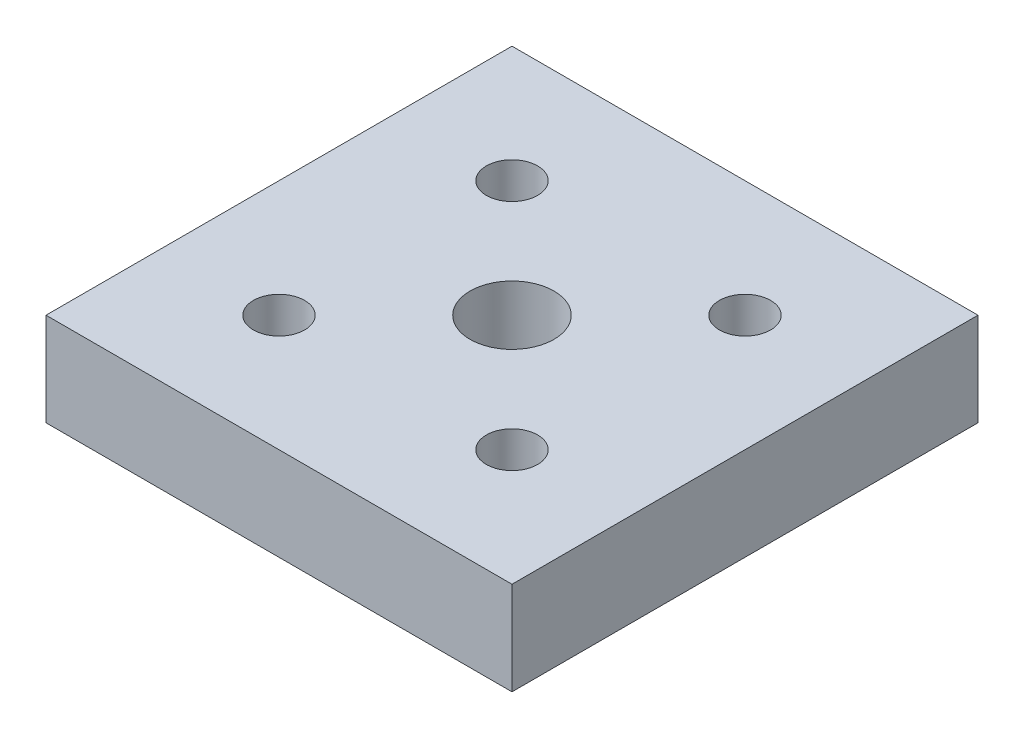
ISO-10303-21;
HEADER;
FILE_DESCRIPTION(('STEP AP214'),'2;1');
FILE_NAME('part.step','',(''),(''),'','','');
FILE_SCHEMA(('AUTOMOTIVE_DESIGN { 1 0 10303 214 1 1 1 1 }'));
ENDSEC;
DATA;
#1=APPLICATION_CONTEXT('core data for automotive mechanical design processes');
#2=APPLICATION_PROTOCOL_DEFINITION('international standard','automotive_design',2000,#1);
#3=PRODUCT_CONTEXT('',#1,'mechanical');
#4=PRODUCT('Part','Part','',(#3));
#5=PRODUCT_RELATED_PRODUCT_CATEGORY('part','',(#4));
#6=PRODUCT_DEFINITION_FORMATION('','',#4);
#7=PRODUCT_DEFINITION_CONTEXT('part definition',#1,'design');
#8=PRODUCT_DEFINITION('design','',#6,#7);
#9=PRODUCT_DEFINITION_SHAPE('','',#8);
#10=(LENGTH_UNIT() NAMED_UNIT(*) SI_UNIT(.MILLI.,.METRE.));
#11=(NAMED_UNIT(*) PLANE_ANGLE_UNIT() SI_UNIT($,.RADIAN.));
#12=(NAMED_UNIT(*) SI_UNIT($,.STERADIAN.) SOLID_ANGLE_UNIT());
#13=UNCERTAINTY_MEASURE_WITH_UNIT(LENGTH_MEASURE(1.E-05),#10,'distance_accuracy_value','');
#14=(GEOMETRIC_REPRESENTATION_CONTEXT(3) GLOBAL_UNCERTAINTY_ASSIGNED_CONTEXT((#13)) GLOBAL_UNIT_ASSIGNED_CONTEXT((#10,
#11,#12)) REPRESENTATION_CONTEXT('',''));
#15=CARTESIAN_POINT('',(0.,0.,0.));
#16=DIRECTION('',(0.,0.,1.));
#17=DIRECTION('',(1.,0.,0.));
#18=AXIS2_PLACEMENT_3D('',#15,#16,#17);
#19=CARTESIAN_POINT('',(0.,12.,0.));
#20=DIRECTION('',(1.,0.,0.));
#21=DIRECTION('',(0.,0.,-1.));
#22=AXIS2_PLACEMENT_3D('',#19,#20,#21);
#23=PLANE('',#22);
#24=DIRECTION('',(0.,0.,1.));
#25=VECTOR('',#24,1.);
#26=CARTESIAN_POINT('',(0.,0.,0.));
#27=LINE('',#26,#25);
#28=CARTESIAN_POINT('',(0.,0.,-60.));
#29=VERTEX_POINT('',#28);
#30=CARTESIAN_POINT('',(0.,0.,0.));
#31=VERTEX_POINT('',#30);
#32=EDGE_CURVE('E102',#29,#31,#27,.T.);
#33=ORIENTED_EDGE('',*,*,#32,.T.);
#34=DIRECTION('',(0.,-1.,0.));
#35=VECTOR('',#34,1.);
#36=CARTESIAN_POINT('',(0.,12.,0.));
#37=LINE('',#36,#35);
#38=CARTESIAN_POINT('',(0.,12.,0.));
#39=VERTEX_POINT('',#38);
#40=EDGE_CURVE('E11',#39,#31,#37,.T.);
#41=ORIENTED_EDGE('',*,*,#40,.F.);
#42=DIRECTION('',(0.,0.,1.));
#43=VECTOR('',#42,1.);
#44=CARTESIAN_POINT('',(0.,12.,0.));
#45=LINE('',#44,#43);
#46=CARTESIAN_POINT('',(0.,12.,-60.));
#47=VERTEX_POINT('',#46);
#48=EDGE_CURVE('E90',#47,#39,#45,.T.);
#49=ORIENTED_EDGE('',*,*,#48,.F.);
#50=DIRECTION('',(0.,-1.,0.));
#51=VECTOR('',#50,1.);
#52=CARTESIAN_POINT('',(0.,12.,-60.));
#53=LINE('',#52,#51);
#54=EDGE_CURVE('E98',#47,#29,#53,.T.);
#55=ORIENTED_EDGE('',*,*,#54,.T.);
#56=EDGE_LOOP('',(#33,#41,#49,#55));
#57=FACE_BOUND('',#56,.T.);
#58=ADVANCED_FACE('F39',(#57),#23,.F.);
#59=CARTESIAN_POINT('',(0.,12.,0.));
#60=DIRECTION('',(0.,0.,-1.));
#61=DIRECTION('',(-1.,0.,0.));
#62=AXIS2_PLACEMENT_3D('',#59,#60,#61);
#63=PLANE('',#62);
#64=DIRECTION('',(1.,0.,0.));
#65=VECTOR('',#64,1.);
#66=CARTESIAN_POINT('',(0.,0.,0.));
#67=LINE('',#66,#65);
#68=CARTESIAN_POINT('',(60.,0.,0.));
#69=VERTEX_POINT('',#68);
#70=EDGE_CURVE('E94',#31,#69,#67,.T.);
#71=ORIENTED_EDGE('',*,*,#70,.T.);
#72=DIRECTION('',(0.,-1.,0.));
#73=VECTOR('',#72,1.);
#74=CARTESIAN_POINT('',(60.,12.,0.));
#75=LINE('',#74,#73);
#76=CARTESIAN_POINT('',(60.,12.,0.));
#77=VERTEX_POINT('',#76);
#78=EDGE_CURVE('E47',#77,#69,#75,.T.);
#79=ORIENTED_EDGE('',*,*,#78,.F.);
#80=DIRECTION('',(1.,0.,0.));
#81=VECTOR('',#80,1.);
#82=CARTESIAN_POINT('',(0.,12.,0.));
#83=LINE('',#82,#81);
#84=EDGE_CURVE('E85',#39,#77,#83,.T.);
#85=ORIENTED_EDGE('',*,*,#84,.F.);
#86=ORIENTED_EDGE('',*,*,#40,.T.);
#87=EDGE_LOOP('',(#71,#79,#85,#86));
#88=FACE_BOUND('',#87,.T.);
#89=ADVANCED_FACE('F93',(#88),#63,.F.);
#90=CARTESIAN_POINT('',(60.,12.,0.));
#91=DIRECTION('',(-1.,0.,0.));
#92=DIRECTION('',(0.,0.,1.));
#93=AXIS2_PLACEMENT_3D('',#90,#91,#92);
#94=PLANE('',#93);
#95=DIRECTION('',(0.,0.,-1.));
#96=VECTOR('',#95,1.);
#97=CARTESIAN_POINT('',(60.,0.,0.));
#98=LINE('',#97,#96);
#99=CARTESIAN_POINT('',(60.,0.,-60.));
#100=VERTEX_POINT('',#99);
#101=EDGE_CURVE('E72',#69,#100,#98,.T.);
#102=ORIENTED_EDGE('',*,*,#101,.T.);
#103=DIRECTION('',(0.,-1.,0.));
#104=VECTOR('',#103,1.);
#105=CARTESIAN_POINT('',(60.,12.,-60.));
#106=LINE('',#105,#104);
#107=CARTESIAN_POINT('',(60.,12.,-60.));
#108=VERTEX_POINT('',#107);
#109=EDGE_CURVE('E95',#108,#100,#106,.T.);
#110=ORIENTED_EDGE('',*,*,#109,.F.);
#111=DIRECTION('',(0.,0.,-1.));
#112=VECTOR('',#111,1.);
#113=CARTESIAN_POINT('',(60.,12.,0.));
#114=LINE('',#113,#112);
#115=EDGE_CURVE('E88',#77,#108,#114,.T.);
#116=ORIENTED_EDGE('',*,*,#115,.F.);
#117=ORIENTED_EDGE('',*,*,#78,.T.);
#118=EDGE_LOOP('',(#102,#110,#116,#117));
#119=FACE_BOUND('',#118,.T.);
#120=ADVANCED_FACE('F96',(#119),#94,.F.);
#121=CARTESIAN_POINT('',(0.,12.,-60.));
#122=DIRECTION('',(0.,0.,1.));
#123=DIRECTION('',(1.,0.,0.));
#124=AXIS2_PLACEMENT_3D('',#121,#122,#123);
#125=PLANE('',#124);
#126=DIRECTION('',(-1.,0.,0.));
#127=VECTOR('',#126,1.);
#128=CARTESIAN_POINT('',(0.,0.,-60.));
#129=LINE('',#128,#127);
#130=EDGE_CURVE('E78',#100,#29,#129,.T.);
#131=ORIENTED_EDGE('',*,*,#130,.T.);
#132=ORIENTED_EDGE('',*,*,#54,.F.);
#133=DIRECTION('',(-1.,0.,0.));
#134=VECTOR('',#133,1.);
#135=CARTESIAN_POINT('',(0.,12.,-60.));
#136=LINE('',#135,#134);
#137=EDGE_CURVE('E55',#108,#47,#136,.T.);
#138=ORIENTED_EDGE('',*,*,#137,.F.);
#139=ORIENTED_EDGE('',*,*,#109,.T.);
#140=EDGE_LOOP('',(#131,#132,#138,#139));
#141=FACE_BOUND('',#140,.T.);
#142=ADVANCED_FACE('F110',(#141),#125,.F.);
#143=CARTESIAN_POINT('',(0.,12.,-60.));
#144=DIRECTION('',(0.,-1.,0.));
#145=DIRECTION('',(0.,0.,-1.));
#146=AXIS2_PLACEMENT_3D('',#143,#144,#145);
#147=PLANE('',#146);
#148=CARTESIAN_POINT('',(15.,12.,-15.));
#149=DIRECTION('',(0.,-1.,0.));
#150=DIRECTION('',(0.,0.,-1.));
#151=AXIS2_PLACEMENT_3D('',#148,#149,#150);
#152=CIRCLE('',#151,3.30000000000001);
#153=CARTESIAN_POINT('',(15.,12.,-18.3));
#154=VERTEX_POINT('',#153);
#155=EDGE_CURVE('E157',#154,#154,#152,.T.);
#156=ORIENTED_EDGE('',*,*,#155,.T.);
#157=EDGE_LOOP('',(#156));
#158=FACE_BOUND('',#157,.T.);
#159=CARTESIAN_POINT('',(45.,12.,-15.));
#160=DIRECTION('',(0.,-1.,0.));
#161=DIRECTION('',(0.,0.,-1.));
#162=AXIS2_PLACEMENT_3D('',#159,#160,#161);
#163=CIRCLE('',#162,3.30000000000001);
#164=CARTESIAN_POINT('',(45.,12.,-18.3));
#165=VERTEX_POINT('',#164);
#166=EDGE_CURVE('E145',#165,#165,#163,.T.);
#167=ORIENTED_EDGE('',*,*,#166,.T.);
#168=EDGE_LOOP('',(#167));
#169=FACE_BOUND('',#168,.T.);
#170=CARTESIAN_POINT('',(45.,12.,-45.));
#171=DIRECTION('',(0.,-1.,0.));
#172=DIRECTION('',(0.,0.,-1.));
#173=AXIS2_PLACEMENT_3D('',#170,#171,#172);
#174=CIRCLE('',#173,3.30000000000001);
#175=CARTESIAN_POINT('',(45.,12.,-48.3));
#176=VERTEX_POINT('',#175);
#177=EDGE_CURVE('E133',#176,#176,#174,.T.);
#178=ORIENTED_EDGE('',*,*,#177,.T.);
#179=EDGE_LOOP('',(#178));
#180=FACE_BOUND('',#179,.T.);
#181=CARTESIAN_POINT('',(15.,12.,-45.));
#182=DIRECTION('',(0.,-1.,0.));
#183=DIRECTION('',(0.,0.,-1.));
#184=AXIS2_PLACEMENT_3D('',#181,#182,#183);
#185=CIRCLE('',#184,3.30000000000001);
#186=CARTESIAN_POINT('',(15.,12.,-48.3));
#187=VERTEX_POINT('',#186);
#188=EDGE_CURVE('E121',#187,#187,#185,.T.);
#189=ORIENTED_EDGE('',*,*,#188,.T.);
#190=EDGE_LOOP('',(#189));
#191=FACE_BOUND('',#190,.T.);
#192=CARTESIAN_POINT('',(30.,12.,-30.));
#193=DIRECTION('',(0.,-1.,0.));
#194=DIRECTION('',(0.,0.,-1.));
#195=AXIS2_PLACEMENT_3D('',#192,#193,#194);
#196=CIRCLE('',#195,5.4);
#197=CARTESIAN_POINT('',(30.,12.,-35.4));
#198=VERTEX_POINT('',#197);
#199=EDGE_CURVE('E105',#198,#198,#196,.T.);
#200=ORIENTED_EDGE('',*,*,#199,.T.);
#201=EDGE_LOOP('',(#200));
#202=FACE_BOUND('',#201,.T.);
#203=ORIENTED_EDGE('',*,*,#48,.T.);
#204=ORIENTED_EDGE('',*,*,#84,.T.);
#205=ORIENTED_EDGE('',*,*,#115,.T.);
#206=ORIENTED_EDGE('',*,*,#137,.T.);
#207=EDGE_LOOP('',(#203,#204,#205,#206));
#208=FACE_BOUND('',#207,.T.);
#209=ADVANCED_FACE('F86',(#158,#169,#180,#191,#202,#208),#147,.F.);
#210=CARTESIAN_POINT('',(0.,0.,-60.));
#211=DIRECTION('',(0.,-1.,0.));
#212=DIRECTION('',(0.,0.,-1.));
#213=AXIS2_PLACEMENT_3D('',#210,#211,#212);
#214=PLANE('',#213);
#215=CARTESIAN_POINT('',(15.,0.,-15.));
#216=DIRECTION('',(0.,-1.,0.));
#217=DIRECTION('',(0.,0.,-1.));
#218=AXIS2_PLACEMENT_3D('',#215,#216,#217);
#219=CIRCLE('',#218,5.50000000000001);
#220=CARTESIAN_POINT('',(15.,0.,-20.5));
#221=VERTEX_POINT('',#220);
#222=EDGE_CURVE('E166',#221,#221,#219,.T.);
#223=ORIENTED_EDGE('',*,*,#222,.F.);
#224=EDGE_LOOP('',(#223));
#225=FACE_BOUND('',#224,.T.);
#226=CARTESIAN_POINT('',(45.,0.,-15.));
#227=DIRECTION('',(0.,-1.,0.));
#228=DIRECTION('',(0.,0.,-1.));
#229=AXIS2_PLACEMENT_3D('',#226,#227,#228);
#230=CIRCLE('',#229,5.50000000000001);
#231=CARTESIAN_POINT('',(45.,0.,-20.5));
#232=VERTEX_POINT('',#231);
#233=EDGE_CURVE('E154',#232,#232,#230,.T.);
#234=ORIENTED_EDGE('',*,*,#233,.F.);
#235=EDGE_LOOP('',(#234));
#236=FACE_BOUND('',#235,.T.);
#237=CARTESIAN_POINT('',(45.,0.,-45.));
#238=DIRECTION('',(0.,-1.,0.));
#239=DIRECTION('',(0.,0.,-1.));
#240=AXIS2_PLACEMENT_3D('',#237,#238,#239);
#241=CIRCLE('',#240,5.50000000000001);
#242=CARTESIAN_POINT('',(45.,0.,-50.5));
#243=VERTEX_POINT('',#242);
#244=EDGE_CURVE('E142',#243,#243,#241,.T.);
#245=ORIENTED_EDGE('',*,*,#244,.F.);
#246=EDGE_LOOP('',(#245));
#247=FACE_BOUND('',#246,.T.);
#248=CARTESIAN_POINT('',(15.,0.,-45.));
#249=DIRECTION('',(0.,-1.,0.));
#250=DIRECTION('',(0.,0.,-1.));
#251=AXIS2_PLACEMENT_3D('',#248,#249,#250);
#252=CIRCLE('',#251,5.50000000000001);
#253=CARTESIAN_POINT('',(15.,0.,-50.5));
#254=VERTEX_POINT('',#253);
#255=EDGE_CURVE('E130',#254,#254,#252,.T.);
#256=ORIENTED_EDGE('',*,*,#255,.F.);
#257=EDGE_LOOP('',(#256));
#258=FACE_BOUND('',#257,.T.);
#259=CARTESIAN_POINT('',(30.,0.,-30.));
#260=DIRECTION('',(0.,-1.,0.));
#261=DIRECTION('',(0.,0.,-1.));
#262=AXIS2_PLACEMENT_3D('',#259,#260,#261);
#263=CIRCLE('',#262,5.39999999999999);
#264=CARTESIAN_POINT('',(30.,0.,-35.4));
#265=VERTEX_POINT('',#264);
#266=EDGE_CURVE('E118',#265,#265,#263,.T.);
#267=ORIENTED_EDGE('',*,*,#266,.F.);
#268=EDGE_LOOP('',(#267));
#269=FACE_BOUND('',#268,.T.);
#270=ORIENTED_EDGE('',*,*,#32,.F.);
#271=ORIENTED_EDGE('',*,*,#130,.F.);
#272=ORIENTED_EDGE('',*,*,#101,.F.);
#273=ORIENTED_EDGE('',*,*,#70,.F.);
#274=EDGE_LOOP('',(#270,#271,#272,#273));
#275=FACE_BOUND('',#274,.T.);
#276=ADVANCED_FACE('F113',(#225,#236,#247,#258,#269,#275),#214,.T.);
#277=CARTESIAN_POINT('',(30.,0.,-30.));
#278=DIRECTION('',(0.,-1.,0.));
#279=DIRECTION('',(0.,0.,-1.));
#280=AXIS2_PLACEMENT_3D('',#277,#278,#279);
#281=CYLINDRICAL_SURFACE('',#280,5.39999999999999);
#282=ORIENTED_EDGE('',*,*,#199,.F.);
#283=EDGE_LOOP('',(#282));
#284=FACE_BOUND('',#283,.T.);
#285=ORIENTED_EDGE('',*,*,#266,.T.);
#286=EDGE_LOOP('',(#285));
#287=FACE_BOUND('',#286,.T.);
#288=ADVANCED_FACE('F174',(#284,#287),#281,.F.);
#289=CARTESIAN_POINT('',(15.,0.,-45.));
#290=DIRECTION('',(0.,-1.,0.));
#291=DIRECTION('',(0.,0.,-1.));
#292=AXIS2_PLACEMENT_3D('',#289,#290,#291);
#293=CYLINDRICAL_SURFACE('',#292,3.30000000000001);
#294=ORIENTED_EDGE('',*,*,#188,.F.);
#295=EDGE_LOOP('',(#294));
#296=FACE_BOUND('',#295,.T.);
#297=CARTESIAN_POINT('',(15.,6.5,-45.));
#298=DIRECTION('',(0.,-1.,0.));
#299=DIRECTION('',(0.,0.,-1.));
#300=AXIS2_PLACEMENT_3D('',#297,#298,#299);
#301=CIRCLE('',#300,3.30000000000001);
#302=CARTESIAN_POINT('',(15.,6.5,-48.3));
#303=VERTEX_POINT('',#302);
#304=EDGE_CURVE('E124',#303,#303,#301,.T.);
#305=ORIENTED_EDGE('',*,*,#304,.T.);
#306=EDGE_LOOP('',(#305));
#307=FACE_BOUND('',#306,.T.);
#308=ADVANCED_FACE('F185',(#296,#307),#293,.F.);
#309=CARTESIAN_POINT('',(18.3,6.5,-45.));
#310=DIRECTION('',(0.,1.,0.));
#311=DIRECTION('',(0.,0.,1.));
#312=AXIS2_PLACEMENT_3D('',#309,#310,#311);
#313=PLANE('',#312);
#314=ORIENTED_EDGE('',*,*,#304,.F.);
#315=EDGE_LOOP('',(#314));
#316=FACE_BOUND('',#315,.T.);
#317=CARTESIAN_POINT('',(15.,6.5,-45.));
#318=DIRECTION('',(0.,-1.,0.));
#319=DIRECTION('',(0.,0.,-1.));
#320=AXIS2_PLACEMENT_3D('',#317,#318,#319);
#321=CIRCLE('',#320,5.50000000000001);
#322=CARTESIAN_POINT('',(15.,6.5,-50.5));
#323=VERTEX_POINT('',#322);
#324=EDGE_CURVE('E127',#323,#323,#321,.T.);
#325=ORIENTED_EDGE('',*,*,#324,.T.);
#326=EDGE_LOOP('',(#325));
#327=FACE_BOUND('',#326,.T.);
#328=ADVANCED_FACE('F191',(#316,#327),#313,.F.);
#329=CARTESIAN_POINT('',(15.,0.,-45.));
#330=DIRECTION('',(0.,-1.,0.));
#331=DIRECTION('',(0.,0.,-1.));
#332=AXIS2_PLACEMENT_3D('',#329,#330,#331);
#333=CYLINDRICAL_SURFACE('',#332,5.50000000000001);
#334=ORIENTED_EDGE('',*,*,#324,.F.);
#335=EDGE_LOOP('',(#334));
#336=FACE_BOUND('',#335,.T.);
#337=ORIENTED_EDGE('',*,*,#255,.T.);
#338=EDGE_LOOP('',(#337));
#339=FACE_BOUND('',#338,.T.);
#340=ADVANCED_FACE('F223',(#336,#339),#333,.F.);
#341=CARTESIAN_POINT('',(45.,0.,-45.));
#342=DIRECTION('',(0.,-1.,0.));
#343=DIRECTION('',(0.,0.,-1.));
#344=AXIS2_PLACEMENT_3D('',#341,#342,#343);
#345=CYLINDRICAL_SURFACE('',#344,3.30000000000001);
#346=ORIENTED_EDGE('',*,*,#177,.F.);
#347=EDGE_LOOP('',(#346));
#348=FACE_BOUND('',#347,.T.);
#349=CARTESIAN_POINT('',(45.,6.5,-45.));
#350=DIRECTION('',(0.,-1.,0.));
#351=DIRECTION('',(0.,0.,-1.));
#352=AXIS2_PLACEMENT_3D('',#349,#350,#351);
#353=CIRCLE('',#352,3.30000000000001);
#354=CARTESIAN_POINT('',(45.,6.5,-48.3));
#355=VERTEX_POINT('',#354);
#356=EDGE_CURVE('E136',#355,#355,#353,.T.);
#357=ORIENTED_EDGE('',*,*,#356,.T.);
#358=EDGE_LOOP('',(#357));
#359=FACE_BOUND('',#358,.T.);
#360=ADVANCED_FACE('F229',(#348,#359),#345,.F.);
#361=CARTESIAN_POINT('',(48.3,6.5,-45.));
#362=DIRECTION('',(0.,1.,0.));
#363=DIRECTION('',(0.,0.,1.));
#364=AXIS2_PLACEMENT_3D('',#361,#362,#363);
#365=PLANE('',#364);
#366=ORIENTED_EDGE('',*,*,#356,.F.);
#367=EDGE_LOOP('',(#366));
#368=FACE_BOUND('',#367,.T.);
#369=CARTESIAN_POINT('',(45.,6.5,-45.));
#370=DIRECTION('',(0.,-1.,0.));
#371=DIRECTION('',(0.,0.,-1.));
#372=AXIS2_PLACEMENT_3D('',#369,#370,#371);
#373=CIRCLE('',#372,5.50000000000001);
#374=CARTESIAN_POINT('',(45.,6.5,-50.5));
#375=VERTEX_POINT('',#374);
#376=EDGE_CURVE('E139',#375,#375,#373,.T.);
#377=ORIENTED_EDGE('',*,*,#376,.T.);
#378=EDGE_LOOP('',(#377));
#379=FACE_BOUND('',#378,.T.);
#380=ADVANCED_FACE('F234',(#368,#379),#365,.F.);
#381=CARTESIAN_POINT('',(45.,0.,-45.));
#382=DIRECTION('',(0.,-1.,0.));
#383=DIRECTION('',(0.,0.,-1.));
#384=AXIS2_PLACEMENT_3D('',#381,#382,#383);
#385=CYLINDRICAL_SURFACE('',#384,5.50000000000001);
#386=ORIENTED_EDGE('',*,*,#376,.F.);
#387=EDGE_LOOP('',(#386));
#388=FACE_BOUND('',#387,.T.);
#389=ORIENTED_EDGE('',*,*,#244,.T.);
#390=EDGE_LOOP('',(#389));
#391=FACE_BOUND('',#390,.T.);
#392=ADVANCED_FACE('F240',(#388,#391),#385,.F.);
#393=CARTESIAN_POINT('',(45.,0.,-15.));
#394=DIRECTION('',(0.,-1.,0.));
#395=DIRECTION('',(0.,0.,-1.));
#396=AXIS2_PLACEMENT_3D('',#393,#394,#395);
#397=CYLINDRICAL_SURFACE('',#396,3.30000000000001);
#398=ORIENTED_EDGE('',*,*,#166,.F.);
#399=EDGE_LOOP('',(#398));
#400=FACE_BOUND('',#399,.T.);
#401=CARTESIAN_POINT('',(45.,6.5,-15.));
#402=DIRECTION('',(0.,-1.,0.));
#403=DIRECTION('',(0.,0.,-1.));
#404=AXIS2_PLACEMENT_3D('',#401,#402,#403);
#405=CIRCLE('',#404,3.30000000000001);
#406=CARTESIAN_POINT('',(45.,6.5,-18.3));
#407=VERTEX_POINT('',#406);
#408=EDGE_CURVE('E148',#407,#407,#405,.T.);
#409=ORIENTED_EDGE('',*,*,#408,.T.);
#410=EDGE_LOOP('',(#409));
#411=FACE_BOUND('',#410,.T.);
#412=ADVANCED_FACE('F244',(#400,#411),#397,.F.);
#413=CARTESIAN_POINT('',(48.3,6.5,-15.));
#414=DIRECTION('',(0.,1.,0.));
#415=DIRECTION('',(0.,0.,1.));
#416=AXIS2_PLACEMENT_3D('',#413,#414,#415);
#417=PLANE('',#416);
#418=ORIENTED_EDGE('',*,*,#408,.F.);
#419=EDGE_LOOP('',(#418));
#420=FACE_BOUND('',#419,.T.);
#421=CARTESIAN_POINT('',(45.,6.5,-15.));
#422=DIRECTION('',(0.,-1.,0.));
#423=DIRECTION('',(0.,0.,-1.));
#424=AXIS2_PLACEMENT_3D('',#421,#422,#423);
#425=CIRCLE('',#424,5.50000000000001);
#426=CARTESIAN_POINT('',(45.,6.5,-20.5));
#427=VERTEX_POINT('',#426);
#428=EDGE_CURVE('E151',#427,#427,#425,.T.);
#429=ORIENTED_EDGE('',*,*,#428,.T.);
#430=EDGE_LOOP('',(#429));
#431=FACE_BOUND('',#430,.T.);
#432=ADVANCED_FACE('F248',(#420,#431),#417,.F.);
#433=CARTESIAN_POINT('',(45.,0.,-15.));
#434=DIRECTION('',(0.,-1.,0.));
#435=DIRECTION('',(0.,0.,-1.));
#436=AXIS2_PLACEMENT_3D('',#433,#434,#435);
#437=CYLINDRICAL_SURFACE('',#436,5.50000000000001);
#438=ORIENTED_EDGE('',*,*,#428,.F.);
#439=EDGE_LOOP('',(#438));
#440=FACE_BOUND('',#439,.T.);
#441=ORIENTED_EDGE('',*,*,#233,.T.);
#442=EDGE_LOOP('',(#441));
#443=FACE_BOUND('',#442,.T.);
#444=ADVANCED_FACE('F252',(#440,#443),#437,.F.);
#445=CARTESIAN_POINT('',(15.,0.,-15.));
#446=DIRECTION('',(0.,-1.,0.));
#447=DIRECTION('',(0.,0.,-1.));
#448=AXIS2_PLACEMENT_3D('',#445,#446,#447);
#449=CYLINDRICAL_SURFACE('',#448,3.30000000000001);
#450=ORIENTED_EDGE('',*,*,#155,.F.);
#451=EDGE_LOOP('',(#450));
#452=FACE_BOUND('',#451,.T.);
#453=CARTESIAN_POINT('',(15.,6.5,-15.));
#454=DIRECTION('',(0.,-1.,0.));
#455=DIRECTION('',(0.,0.,-1.));
#456=AXIS2_PLACEMENT_3D('',#453,#454,#455);
#457=CIRCLE('',#456,3.30000000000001);
#458=CARTESIAN_POINT('',(15.,6.5,-18.3));
#459=VERTEX_POINT('',#458);
#460=EDGE_CURVE('E160',#459,#459,#457,.T.);
#461=ORIENTED_EDGE('',*,*,#460,.T.);
#462=EDGE_LOOP('',(#461));
#463=FACE_BOUND('',#462,.T.);
#464=ADVANCED_FACE('F256',(#452,#463),#449,.F.);
#465=CARTESIAN_POINT('',(18.3,6.5,-15.));
#466=DIRECTION('',(0.,1.,0.));
#467=DIRECTION('',(0.,0.,1.));
#468=AXIS2_PLACEMENT_3D('',#465,#466,#467);
#469=PLANE('',#468);
#470=ORIENTED_EDGE('',*,*,#460,.F.);
#471=EDGE_LOOP('',(#470));
#472=FACE_BOUND('',#471,.T.);
#473=CARTESIAN_POINT('',(15.,6.5,-15.));
#474=DIRECTION('',(0.,-1.,0.));
#475=DIRECTION('',(0.,0.,-1.));
#476=AXIS2_PLACEMENT_3D('',#473,#474,#475);
#477=CIRCLE('',#476,5.50000000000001);
#478=CARTESIAN_POINT('',(15.,6.5,-20.5));
#479=VERTEX_POINT('',#478);
#480=EDGE_CURVE('E163',#479,#479,#477,.T.);
#481=ORIENTED_EDGE('',*,*,#480,.T.);
#482=EDGE_LOOP('',(#481));
#483=FACE_BOUND('',#482,.T.);
#484=ADVANCED_FACE('F260',(#472,#483),#469,.F.);
#485=CARTESIAN_POINT('',(15.,0.,-15.));
#486=DIRECTION('',(0.,-1.,0.));
#487=DIRECTION('',(0.,0.,-1.));
#488=AXIS2_PLACEMENT_3D('',#485,#486,#487);
#489=CYLINDRICAL_SURFACE('',#488,5.50000000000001);
#490=ORIENTED_EDGE('',*,*,#480,.F.);
#491=EDGE_LOOP('',(#490));
#492=FACE_BOUND('',#491,.T.);
#493=ORIENTED_EDGE('',*,*,#222,.T.);
#494=EDGE_LOOP('',(#493));
#495=FACE_BOUND('',#494,.T.);
#496=ADVANCED_FACE('F170',(#492,#495),#489,.F.);
#497=CLOSED_SHELL('',(#58,#89,#120,#142,#209,#276,#288,#308,#328,#340,#360,#380,#392,#412,#432,
#444,#464,#484,#496));
#498=MANIFOLD_SOLID_BREP('B2',#497);
#499=ADVANCED_BREP_SHAPE_REPRESENTATION('',(#18,#498),#14);
#500=SHAPE_DEFINITION_REPRESENTATION(#9,#499);
ENDSEC;
END-ISO-10303-21;
